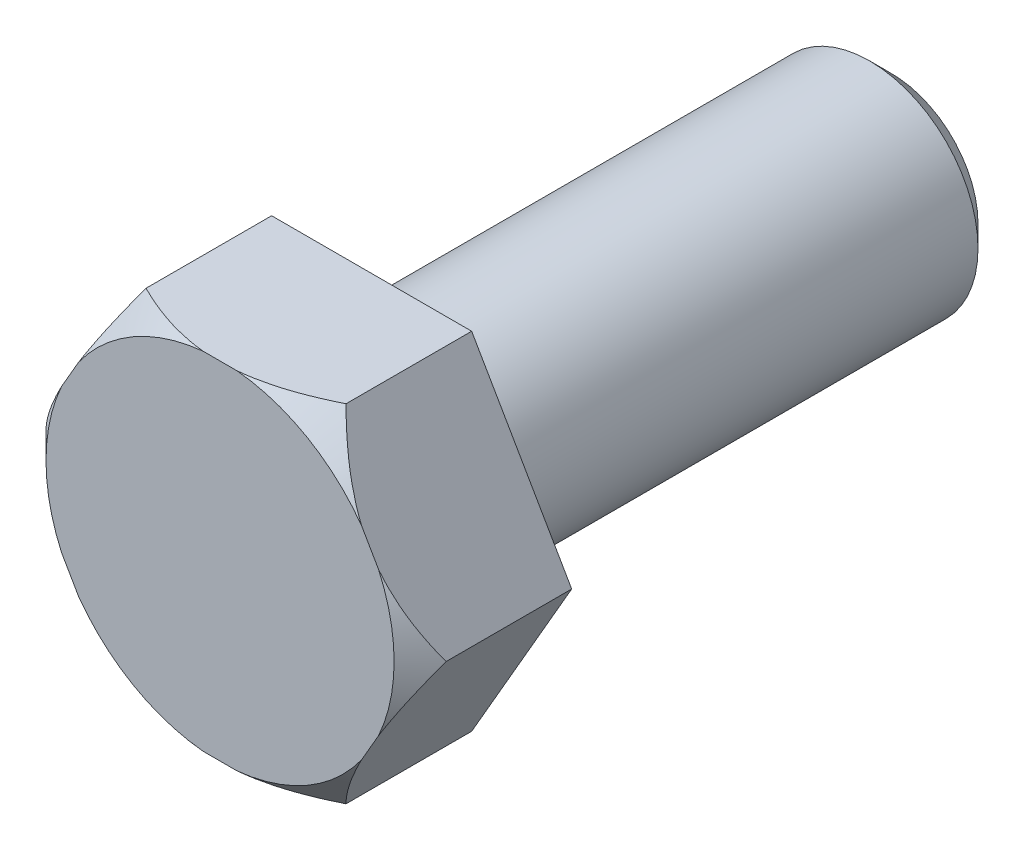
from build123d import *

# Parameters (mm, degrees)
BOSS_EXTRU_1_DEPTH = 3.5


with BuildPart() as part:
    # Esquisse1 → Boss.-Extru.1 (new body)
    with BuildSketch(Plane.XY):
        Polygon((4.618802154, 0), (2.309401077, 4), (-2.309401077, 4), (-4.618802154, 0), (-2.309401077, -4), (2.309401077, -4), align=None)
    extrude(amount=BOSS_EXTRU_1_DEPTH)

    # Esquisse3 → Enl_vement de mati_re-R_volution2 (revolve, cut)
    with BuildSketch(Plane(origin=(0, 0, 0), x_dir=(1, 0, 0), z_dir=(0, 1, 0))):
        Polygon((-4.618802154, -2.9), (-4.018802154, -3.5), (-4.018802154, -6.542860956), (-9.024896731, -6.542860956), (-9.024896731, -2.9), align=None)
    revolve(axis=Axis((0, 0, -2.903094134), (0, 0, 1)), mode=Mode.SUBTRACT)


with BuildPart() as body_2:
    # Esquisse4 → R_volution2 (revolve)
    with BuildSketch(Plane(origin=(0, 0, 0), x_dir=(0, 0, -1), z_dir=(1, 0, 0)), mode=Mode.PRIVATE) as r_volution2_sk:
        Polygon((0, -2.5), (11.5, -2.5), (12, -2), (12, 0), (0, 0), align=None)
    revolve(r_volution2_sk.sketch.rotate(Axis((0, 0, 0), (0, 0, -1)), 270), axis=Axis((0, 0, 0), (0, 0, -1)))


solid = Compound([part.part, body_2.part])
